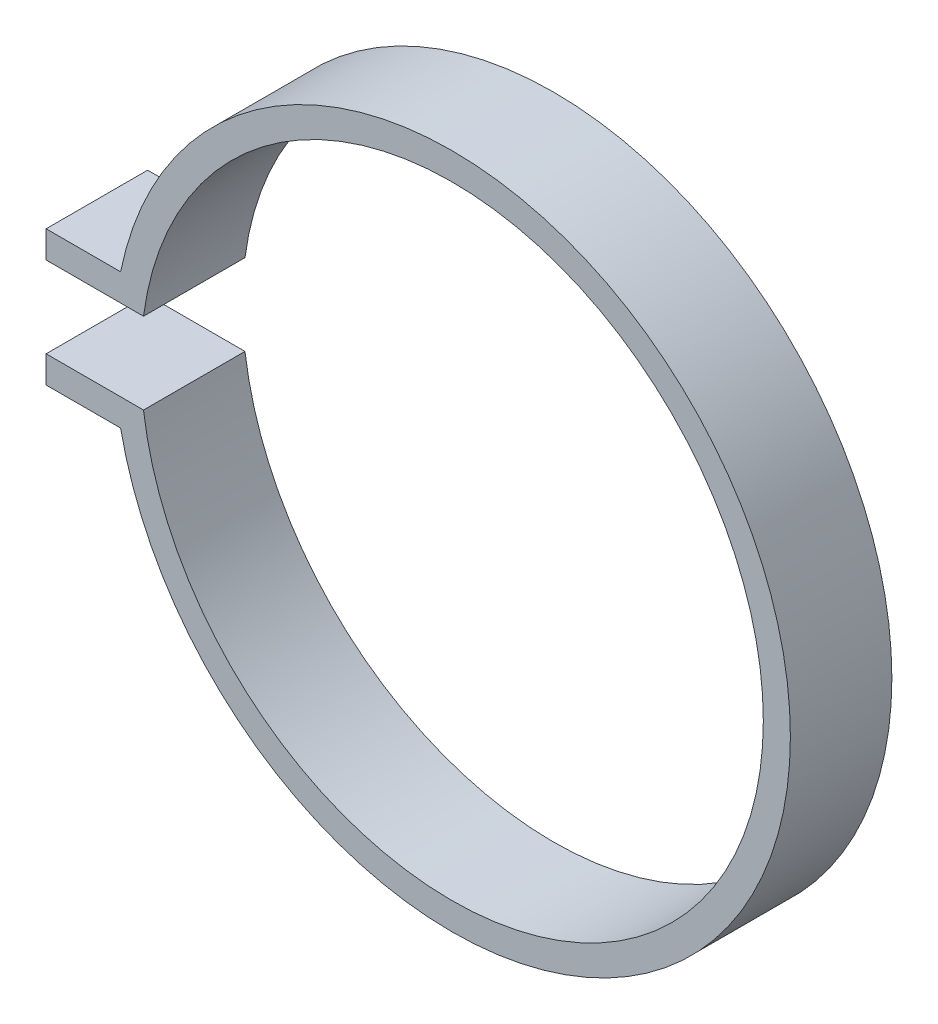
from build123d import *

# Parameters (mm, degrees)
BOSS_EXTRUDE1_DEPTH = 15


with BuildPart() as part:
    # Sketch2 → Boss-Extrude1 (new body)
    with BuildSketch(Plane.XY):
        with BuildLine():
            Line((-48.989794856, 10), (-60, 10))
            Line((-60, 10), (-60, 6))
            Line((-60, 6), (-45.607017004, 6))
            ThreePointArc((-45.607017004, 6), (46, 0), (-45.607017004, -6))
            Line((-45.607017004, -6), (-60, -6))
            Line((-60, -6), (-60, -10))
            Line((-60, -10), (-48.989794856, -10))
            ThreePointArc((-48.989794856, -10), (50, 0), (-48.989794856, 10))
        make_face()
    extrude(amount=BOSS_EXTRUDE1_DEPTH)


solid = part.part
